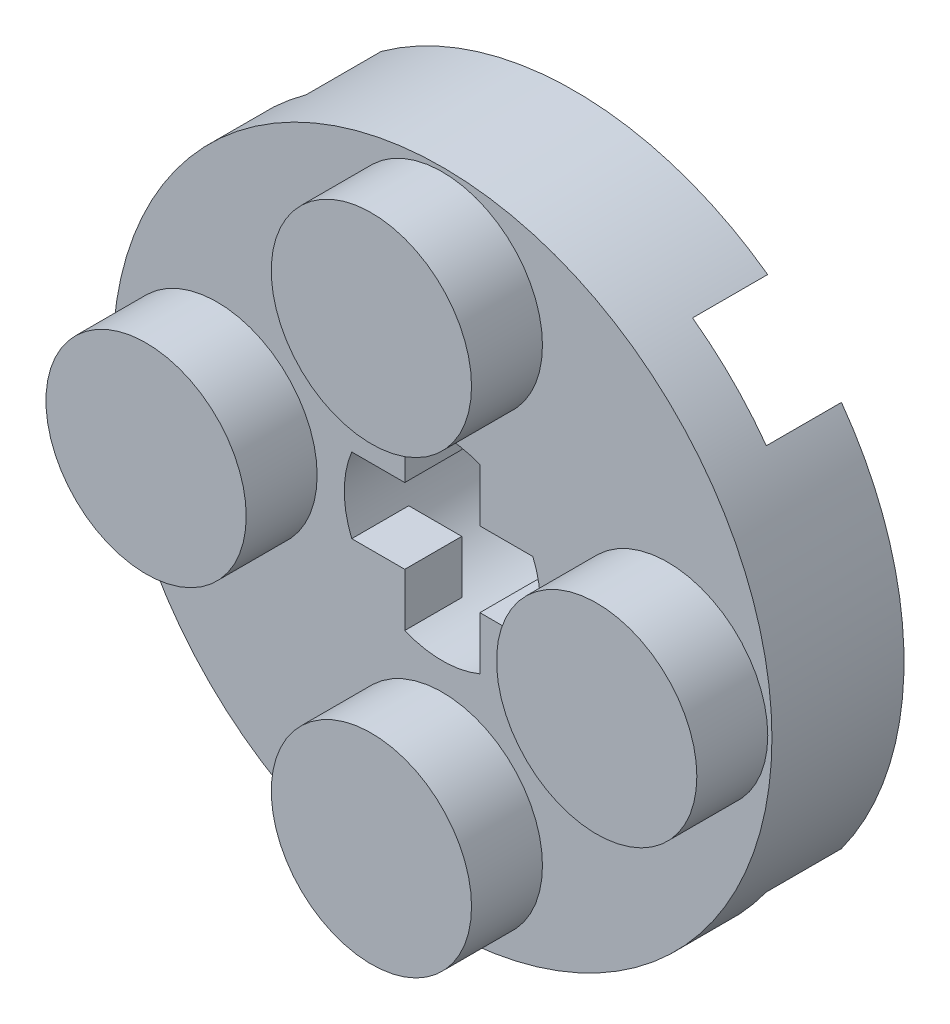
from build123d import *
from build123d.topology import SkipClean

# Parameters (mm, degrees)
CROQUIS1_R          = 7.9
EXTRUIR1_DEPTH      = 3.166
CROQUIS2_R          = 2.4
EXTRUIR2_DEPTH      = 1.7
SKETCH1_W           = 12.8
SKETCH1_H           = 12.8
CUT_EXTRUDE2_DEPTH  = 1.8
CUT_EXTRUDE3_DEPTH  = 12.612215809
SKETCH3_R           = 3
SKETCH3_R_2         = 2.35
BOSS_EXTRUDE1_DEPTH = 1.8


with BuildPart() as part:
    # Croquis1 → Extruir1 (new body)
    with BuildSketch(Plane.XY):
        Circle(CROQUIS1_R)
    extrude(amount=EXTRUIR1_DEPTH)

    # Croquis2 → Extruir2 (add)
    with BuildSketch(Plane.XY.offset(3.166)):
        with Locations((0, 5.4)):
            Circle(CROQUIS2_R)
        with Locations((5.4, 0)):
            Circle(CROQUIS2_R)
        with Locations((0, -5.4)):
            Circle(CROQUIS2_R)
        with Locations((-5.4, 0)):
            Circle(CROQUIS2_R)
    extrude(amount=EXTRUIR2_DEPTH)

    # Sketch1 → Cut-Extrude2 (cut)
    with BuildSketch(Plane(origin=(0, 0, 0), x_dir=(-1, 0, 0), z_dir=(0, 0, -1))):
        Rectangle(SKETCH1_W, SKETCH1_H)
    extrude(amount=-CUT_EXTRUDE2_DEPTH, mode=Mode.SUBTRACT)

    # Sketch2 → Cut-Extrude3 (cut, through all)
    with BuildSketch(Plane.XY.offset(3.166)):
        with BuildLine():
            Line((-2.170829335, 0.9), (-0.9, 0.9))
            Line((-0.9, 0.9), (-0.9, 2.170829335))
            ThreePointArc((-0.9, 2.170829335), (0, 2.35), (0.9, 2.170829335))
            Line((0.9, 2.170829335), (0.9, 0.9))
            Line((0.9, 0.9), (2.170829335, 0.9))
            ThreePointArc((2.170829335, 0.9), (2.35, 0), (2.170829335, -0.9))
            Line((2.170829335, -0.9), (0.9, -0.9))
            Line((0.9, -0.9), (0.9, -2.170829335))
            ThreePointArc((0.9, -2.170829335), (0, -2.35), (-0.9, -2.170829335))
            Line((-0.9, -2.170829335), (-0.9, -0.9))
            Line((-0.9, -0.9), (-2.170829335, -0.9))
            ThreePointArc((-2.170829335, -0.9), (-2.35, 0), (-2.170829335, 0.9))
        make_face()
    extrude(amount=-CUT_EXTRUDE3_DEPTH, mode=Mode.SUBTRACT)

    # Sketch3 → Boss-Extrude1 (add)
    with SkipClean():  # the faces are left unmerged after this step: merging them gives an invalid solid
        with BuildSketch(Plane(origin=(0, 0, 1.8), x_dir=(-1, 0, 0), z_dir=(0, 0, -1))):
            Circle(SKETCH3_R)
            with Locations(Location((0, 0, 0), (0, 0, 202.518314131))):
                Circle(SKETCH3_R_2, mode=Mode.SUBTRACT)
        extrude(amount=BOSS_EXTRUDE1_DEPTH)


solid = part.part
